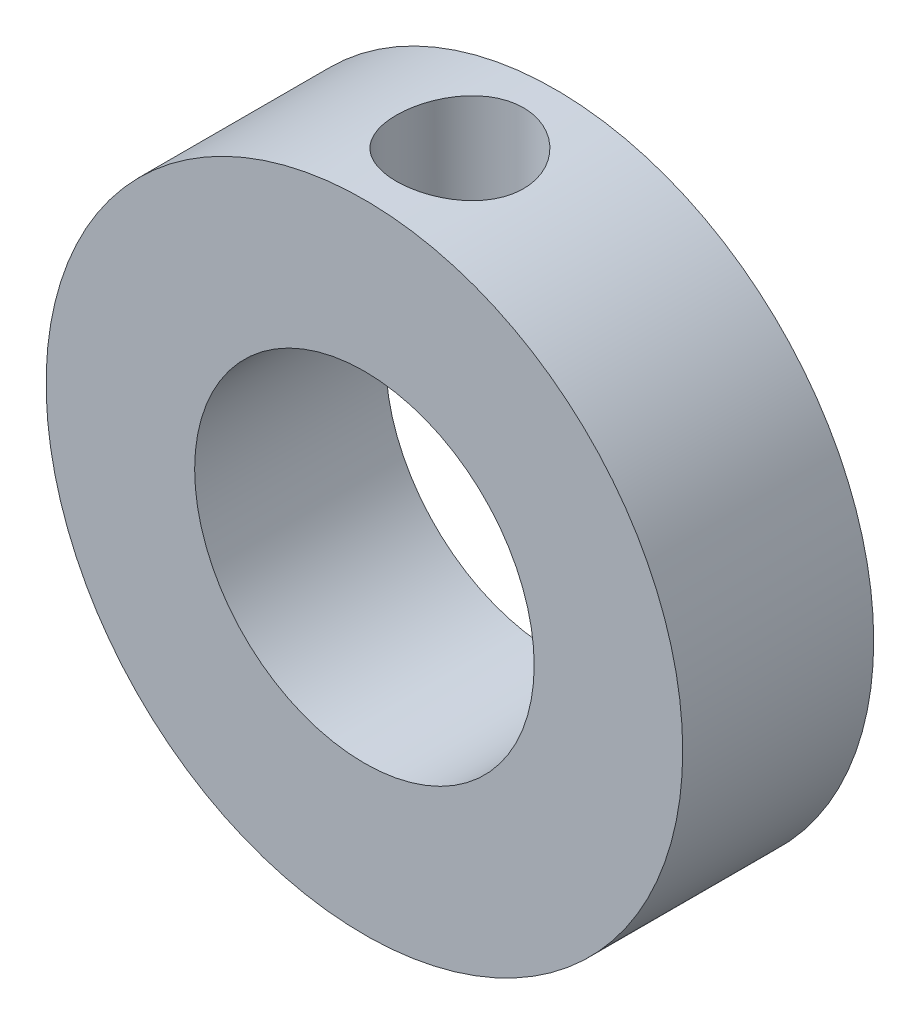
from build123d import *

# Parameters (mm, degrees)
SKETCH1_R          = 15
SKETCH1_R_2        = 8
EXTRUDE1_DEPTH     = 4.5
SKETCH2_R          = 3
CUT_EXTRUDE1_DEPTH = 9


with BuildPart() as part:
    # Sketch1 → Extrude1 (new, symmetric)
    with BuildSketch(Plane.XY):
        Circle(SKETCH1_R)
        Circle(SKETCH1_R_2, mode=Mode.SUBTRACT)
    extrude(amount=EXTRUDE1_DEPTH, both=True)

    # Sketch2 → Cut-Extrude1 (cut)
    with BuildSketch(Plane(origin=(0, 15, 0), x_dir=(-1, 0, 0), z_dir=(0, 1, 0))):
        with Locations(Location((0, 0, 0), (0, 0, 90))):
            Circle(SKETCH2_R)
    extrude(amount=-CUT_EXTRUDE1_DEPTH, mode=Mode.SUBTRACT)


solid = part.part
